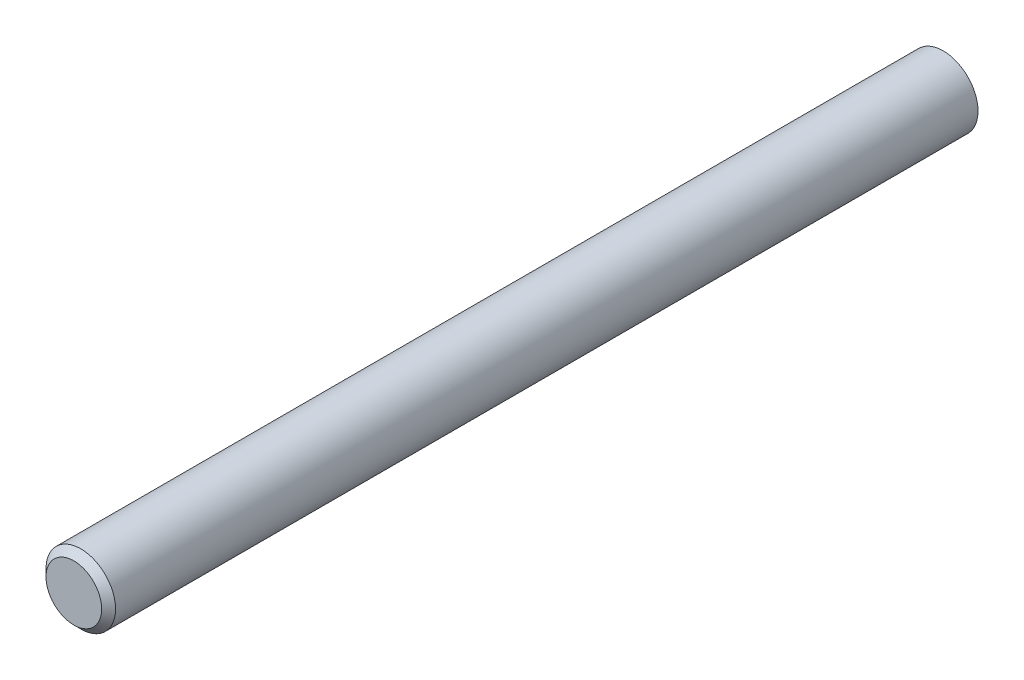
from build123d import *

# Parameters (mm, degrees)
SKETCH1_R           = 2
BOSS_EXTRUDE1_DEPTH = 25
CHAMFER1_SIZE       = 0.4


with BuildPart() as part:
    # Sketch1 → Boss-Extrude1 (new, symmetric)
    with BuildSketch(Plane.XY):
        Circle(SKETCH1_R)
    extrude(amount=BOSS_EXTRUDE1_DEPTH, both=True)

    # Chamfer1
    chamfer1_edges = [part.edges().sort_by_distance(p)[0] for p in [
        (-2, 0, 25),
    ]]
    chamfer(chamfer1_edges, length=CHAMFER1_SIZE)


solid = part.part
